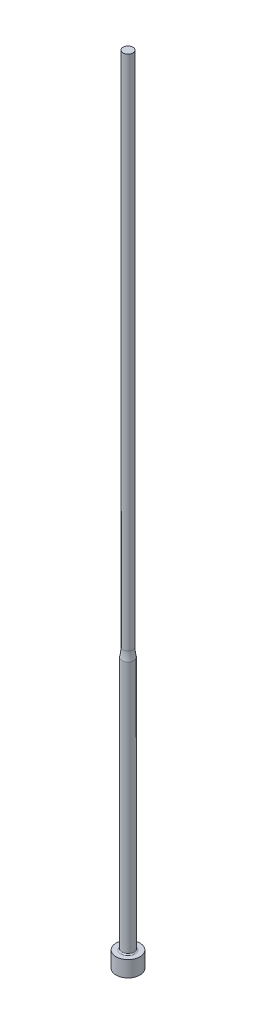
ISO-10303-21;
HEADER;
FILE_DESCRIPTION(('STEP AP214'),'2;1');
FILE_NAME('part.step','',(''),(''),'','','');
FILE_SCHEMA(('AUTOMOTIVE_DESIGN { 1 0 10303 214 1 1 1 1 }'));
ENDSEC;
DATA;
#1=APPLICATION_CONTEXT('core data for automotive mechanical design processes');
#2=APPLICATION_PROTOCOL_DEFINITION('international standard','automotive_design',2000,#1);
#3=PRODUCT_CONTEXT('',#1,'mechanical');
#4=PRODUCT('Part','Part','',(#3));
#5=PRODUCT_RELATED_PRODUCT_CATEGORY('part','',(#4));
#6=PRODUCT_DEFINITION_FORMATION('','',#4);
#7=PRODUCT_DEFINITION_CONTEXT('part definition',#1,'design');
#8=PRODUCT_DEFINITION('design','',#6,#7);
#9=PRODUCT_DEFINITION_SHAPE('','',#8);
#10=(LENGTH_UNIT() NAMED_UNIT(*) SI_UNIT(.MILLI.,.METRE.));
#11=(NAMED_UNIT(*) PLANE_ANGLE_UNIT() SI_UNIT($,.RADIAN.));
#12=(NAMED_UNIT(*) SI_UNIT($,.STERADIAN.) SOLID_ANGLE_UNIT());
#13=UNCERTAINTY_MEASURE_WITH_UNIT(LENGTH_MEASURE(1.E-05),#10,'distance_accuracy_value','');
#14=(GEOMETRIC_REPRESENTATION_CONTEXT(3) GLOBAL_UNCERTAINTY_ASSIGNED_CONTEXT((#13)) GLOBAL_UNIT_ASSIGNED_CONTEXT((#10,
#11,#12)) REPRESENTATION_CONTEXT('',''));
#15=CARTESIAN_POINT('',(0.,0.,0.));
#16=DIRECTION('',(0.,0.,1.));
#17=DIRECTION('',(1.,0.,0.));
#18=AXIS2_PLACEMENT_3D('',#15,#16,#17);
#19=CARTESIAN_POINT('',(1.25000000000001,200.,0.));
#20=DIRECTION('',(0.,-1.,0.));
#21=DIRECTION('',(1.,0.,0.));
#22=AXIS2_PLACEMENT_3D('',#19,#20,#21);
#23=PLANE('',#22);
#24=CARTESIAN_POINT('',(0.,200.,0.));
#25=DIRECTION('',(0.,1.,0.));
#26=DIRECTION('',(-1.,0.,0.));
#27=AXIS2_PLACEMENT_3D('',#24,#25,#26);
#28=CIRCLE('',#27,1.25000000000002);
#29=CARTESIAN_POINT('',(-1.25000000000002,200.,0.));
#30=VERTEX_POINT('',#29);
#31=EDGE_CURVE('E10',#30,#30,#28,.T.);
#32=ORIENTED_EDGE('',*,*,#31,.T.);
#33=EDGE_LOOP('',(#32));
#34=FACE_BOUND('',#33,.T.);
#35=ADVANCED_FACE('F30',(#34),#23,.F.);
#36=CARTESIAN_POINT('',(0.,200.,0.));
#37=DIRECTION('',(0.,1.,0.));
#38=DIRECTION('',(-1.,0.,0.));
#39=AXIS2_PLACEMENT_3D('',#36,#37,#38);
#40=CYLINDRICAL_SURFACE('',#39,1.25000000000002);
#41=ORIENTED_EDGE('',*,*,#31,.F.);
#42=EDGE_LOOP('',(#41));
#43=FACE_BOUND('',#42,.T.);
#44=CARTESIAN_POINT('',(0.,70.,0.));
#45=DIRECTION('',(0.,1.,0.));
#46=DIRECTION('',(-1.,0.,0.));
#47=AXIS2_PLACEMENT_3D('',#44,#45,#46);
#48=CIRCLE('',#47,1.25000000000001);
#49=CARTESIAN_POINT('',(-1.25000000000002,70.,0.));
#50=VERTEX_POINT('',#49);
#51=EDGE_CURVE('E36',#50,#50,#48,.T.);
#52=ORIENTED_EDGE('',*,*,#51,.T.);
#53=EDGE_LOOP('',(#52));
#54=FACE_BOUND('',#53,.T.);
#55=ADVANCED_FACE('F71',(#43,#54),#40,.T.);
#56=CARTESIAN_POINT('',(0.,70.,0.));
#57=DIRECTION('',(0.,1.,0.));
#58=DIRECTION('',(-1.,0.,0.));
#59=AXIS2_PLACEMENT_3D('',#56,#57,#58);
#60=TOROIDAL_SURFACE('',#59,11.25,10.);
#61=ORIENTED_EDGE('',*,*,#51,.F.);
#62=EDGE_LOOP('',(#61));
#63=FACE_BOUND('',#62,.T.);
#64=CARTESIAN_POINT('',(0.,67.7779513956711,0.));
#65=DIRECTION('',(0.,1.,0.));
#66=DIRECTION('',(-1.,0.,0.));
#67=AXIS2_PLACEMENT_3D('',#64,#65,#66);
#68=CIRCLE('',#67,1.50000000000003);
#69=CARTESIAN_POINT('',(-1.50000000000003,67.7779513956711,0.));
#70=VERTEX_POINT('',#69);
#71=EDGE_CURVE('E40',#70,#70,#68,.T.);
#72=ORIENTED_EDGE('',*,*,#71,.T.);
#73=EDGE_LOOP('',(#72));
#74=FACE_BOUND('',#73,.T.);
#75=ADVANCED_FACE('F75',(#63,#74),#60,.F.);
#76=CARTESIAN_POINT('',(0.,200.,0.));
#77=DIRECTION('',(0.,1.,0.));
#78=DIRECTION('',(-1.,0.,0.));
#79=AXIS2_PLACEMENT_3D('',#76,#77,#78);
#80=CYLINDRICAL_SURFACE('',#79,1.50000000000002);
#81=ORIENTED_EDGE('',*,*,#71,.F.);
#82=EDGE_LOOP('',(#81));
#83=FACE_BOUND('',#82,.T.);
#84=CARTESIAN_POINT('',(0.,4.3,0.));
#85=DIRECTION('',(0.,1.,0.));
#86=DIRECTION('',(-1.,0.,0.));
#87=AXIS2_PLACEMENT_3D('',#84,#85,#86);
#88=CIRCLE('',#87,1.50000000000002);
#89=CARTESIAN_POINT('',(-1.50000000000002,4.3,0.));
#90=VERTEX_POINT('',#89);
#91=EDGE_CURVE('E44',#90,#90,#88,.T.);
#92=ORIENTED_EDGE('',*,*,#91,.T.);
#93=EDGE_LOOP('',(#92));
#94=FACE_BOUND('',#93,.T.);
#95=ADVANCED_FACE('F80',(#83,#94),#80,.T.);
#96=CARTESIAN_POINT('',(0.,4.3,0.));
#97=DIRECTION('',(0.,1.,0.));
#98=DIRECTION('',(-1.,0.,0.));
#99=AXIS2_PLACEMENT_3D('',#96,#97,#98);
#100=TOROIDAL_SURFACE('',#99,1.80000000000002,0.3);
#101=ORIENTED_EDGE('',*,*,#91,.F.);
#102=EDGE_LOOP('',(#101));
#103=FACE_BOUND('',#102,.T.);
#104=CARTESIAN_POINT('',(0.,4.,0.));
#105=DIRECTION('',(0.,1.,0.));
#106=DIRECTION('',(-1.,0.,0.));
#107=AXIS2_PLACEMENT_3D('',#104,#105,#106);
#108=CIRCLE('',#107,1.80000000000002);
#109=CARTESIAN_POINT('',(-1.80000000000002,4.,0.));
#110=VERTEX_POINT('',#109);
#111=EDGE_CURVE('E49',#110,#110,#108,.T.);
#112=ORIENTED_EDGE('',*,*,#111,.T.);
#113=EDGE_LOOP('',(#112));
#114=FACE_BOUND('',#113,.T.);
#115=ADVANCED_FACE('F86',(#103,#114),#100,.F.);
#116=CARTESIAN_POINT('',(3.00000000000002,4.,0.));
#117=DIRECTION('',(0.,-1.,0.));
#118=DIRECTION('',(1.,0.,0.));
#119=AXIS2_PLACEMENT_3D('',#116,#117,#118);
#120=PLANE('',#119);
#121=ORIENTED_EDGE('',*,*,#111,.F.);
#122=EDGE_LOOP('',(#121));
#123=FACE_BOUND('',#122,.T.);
#124=CARTESIAN_POINT('',(0.,4.,0.));
#125=DIRECTION('',(0.,1.,0.));
#126=DIRECTION('',(-1.,0.,0.));
#127=AXIS2_PLACEMENT_3D('',#124,#125,#126);
#128=CIRCLE('',#127,3.00000000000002);
#129=CARTESIAN_POINT('',(-3.00000000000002,4.,0.));
#130=VERTEX_POINT('',#129);
#131=EDGE_CURVE('E52',#130,#130,#128,.T.);
#132=ORIENTED_EDGE('',*,*,#131,.T.);
#133=EDGE_LOOP('',(#132));
#134=FACE_BOUND('',#133,.T.);
#135=ADVANCED_FACE('F67',(#123,#134),#120,.F.);
#136=CARTESIAN_POINT('',(0.,200.,0.));
#137=DIRECTION('',(0.,1.,0.));
#138=DIRECTION('',(-1.,0.,0.));
#139=AXIS2_PLACEMENT_3D('',#136,#137,#138);
#140=CYLINDRICAL_SURFACE('',#139,3.00000000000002);
#141=ORIENTED_EDGE('',*,*,#131,.F.);
#142=EDGE_LOOP('',(#141));
#143=FACE_BOUND('',#142,.T.);
#144=CARTESIAN_POINT('',(0.,0.,0.));
#145=DIRECTION('',(0.,1.,0.));
#146=DIRECTION('',(-1.,0.,0.));
#147=AXIS2_PLACEMENT_3D('',#144,#145,#146);
#148=CIRCLE('',#147,3.00000000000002);
#149=CARTESIAN_POINT('',(-3.00000000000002,0.,0.));
#150=VERTEX_POINT('',#149);
#151=EDGE_CURVE('E55',#150,#150,#148,.T.);
#152=ORIENTED_EDGE('',*,*,#151,.T.);
#153=EDGE_LOOP('',(#152));
#154=FACE_BOUND('',#153,.T.);
#155=ADVANCED_FACE('F59',(#143,#154),#140,.T.);
#156=CARTESIAN_POINT('',(0.,0.,0.));
#157=DIRECTION('',(0.,1.,0.));
#158=DIRECTION('',(-1.,0.,0.));
#159=AXIS2_PLACEMENT_3D('',#156,#157,#158);
#160=PLANE('',#159);
#161=ORIENTED_EDGE('',*,*,#151,.F.);
#162=EDGE_LOOP('',(#161));
#163=FACE_BOUND('',#162,.T.);
#164=ADVANCED_FACE('F61',(#163),#160,.F.);
#165=CLOSED_SHELL('',(#35,#55,#75,#95,#115,#135,#155,#164));
#166=MANIFOLD_SOLID_BREP('B2',#165);
#167=ADVANCED_BREP_SHAPE_REPRESENTATION('',(#18,#166),#14);
#168=SHAPE_DEFINITION_REPRESENTATION(#9,#167);
ENDSEC;
END-ISO-10303-21;
